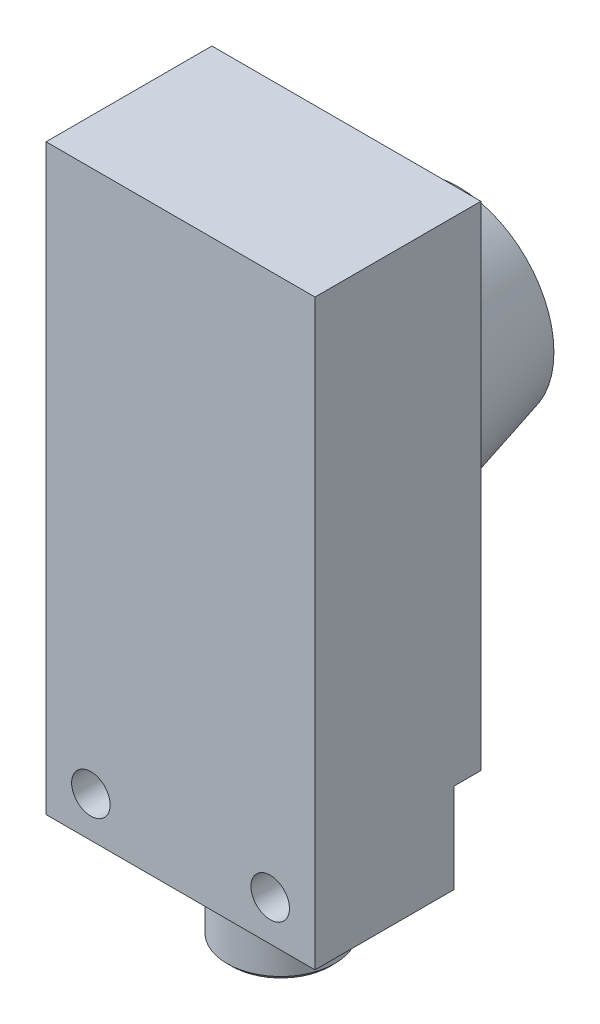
from build123d import *

# Parameters (mm, degrees)
ESQUISSE1_W             = 30
ESQUISSE1_H             = 65
EXTRUSION1_DEPTH        = 18.5
ESQUISSE3_R             = 4
ENL_V_MAT_EXTRU_1_DEPTH = 0.1
ESQUISSE4_W             = 10
ESQUISSE4_H             = 10
ENL_V_MAT_EXTRU_2_DEPTH = 3
ESQUISSE5_R             = 2.15
ENL_V_MAT_EXTRU_3_DEPTH = 20
ESQUISSE6_R             = 6
EXTRUSION2_DEPTH        = 10
CHANFREIN1_SIZE         = 0.5


with BuildPart() as part:
    # Esquisse1 → Extrusion1 (new body)
    with BuildSketch(Plane.XY):
        with Locations((0, -9.5)):
            Rectangle(ESQUISSE1_W, ESQUISSE1_H)
    extrude(amount=EXTRUSION1_DEPTH)

    # Esquisse2 → R_volution1 (revolve)
    with BuildSketch(Plane(origin=(0, 0, 0), x_dir=(0, 0, -1), z_dir=(1, 0, 0)), mode=Mode.PRIVATE) as r_volution1_sk:
        Polygon((0, 14), (12.5, 10.650635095), (12.5, 0), (0, 0), align=None)
    revolve(r_volution1_sk.sketch.rotate(Axis((0, 0, 0), (0, 0, -1)), 180), axis=Axis((0, 0, 0), (0, 0, -1)))

    # Esquisse3 → Enl_v. mat.-Extru.1 (cut)
    with BuildSketch(Plane(origin=(0, 0, -12.5), x_dir=(-1, 0, 0), z_dir=(0, 0, -1))):
        with Locations(Location((0, 0, 0), (0, 0, 90))):
            Circle(ESQUISSE3_R)
    extrude(amount=-ENL_V_MAT_EXTRU_1_DEPTH, mode=Mode.SUBTRACT)

    # Esquisse4 → Enl_v. mat.-Extru.2 (cut)
    with BuildSketch(Plane(origin=(0, 0, 0), x_dir=(-1, 0, 0), z_dir=(0, 0, -1))):
        with Locations((-10, -37)):
            Rectangle(ESQUISSE4_W, ESQUISSE4_H)
        with Locations((10, -37)):
            Rectangle(ESQUISSE4_W, ESQUISSE4_H)
    extrude(amount=-ENL_V_MAT_EXTRU_2_DEPTH, mode=Mode.SUBTRACT)

    # Esquisse5 → Enl_v. mat.-Extru.3 (cut)
    with BuildSketch(Plane(origin=(0, 0, 3), x_dir=(-1, 0, 0), z_dir=(0, 0, -1))):
        with Locations((-10, -37.5)):
            Circle(ESQUISSE5_R)
        with Locations((10, -37.5)):
            Circle(ESQUISSE5_R)
    extrude(amount=-ENL_V_MAT_EXTRU_3_DEPTH, mode=Mode.SUBTRACT)

    # Esquisse6 → Extrusion2 (add)
    with BuildSketch(Plane.XZ.offset(42)):
        with Locations(Location((0, 7.3, 0), (0, 0, 180))):
            Circle(ESQUISSE6_R)
    extrude(amount=EXTRUSION2_DEPTH)

    # Chanfrein1
    chanfrein1_edges = [part.edges().sort_by_distance(p)[0] for p in [
        (6, -52, 7.3),
    ]]
    chamfer(chanfrein1_edges, length=CHANFREIN1_SIZE)


solid = part.part
